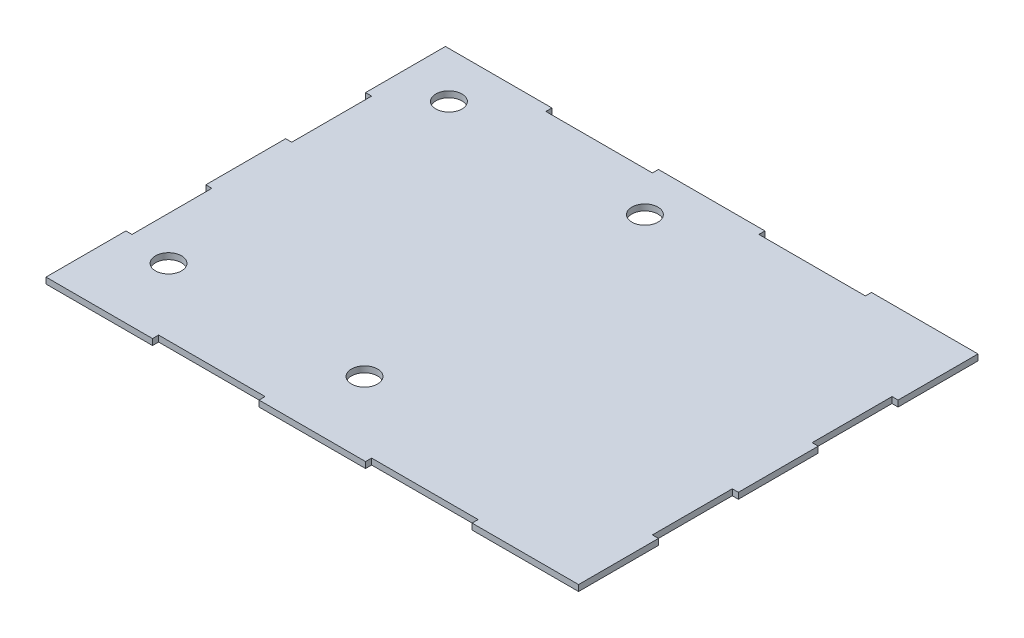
from build123d import *

# Parameters (mm, degrees)
BOSS_EXTRUDE2_DEPTH = 2.28
SKETCH10_4_R        = 4.9
CUT_EXTRUDE2_DEPTH  = 10


with BuildPart() as part:
    # Sketch2 → Boss-Extrude2 (new body)
    with BuildSketch(Plane(origin=(0, 0, 0), x_dir=(1, 0, 0), z_dir=(0, 1, 0))):
        Polygon((-100, -45), (-97.72, -45), (-97.72, -15), (-100, -15), (-100, 15), (-97.72, 15), (-97.72, 45), (-100, 45), (-100, 75), (-60, 75), (-60, 72.72), (-20, 72.72), (-20, 75), (20, 75), (20, 72.72), (60, 72.72), (60, 75), (100, 75), (100, 45), (97.72, 45), (97.72, 15), (100, 15), (100, -15), (97.72, -15), (97.72, -45), (100, -45), (100, -75), (60, -75), (60, -72.72), (20, -72.72), (20, -75), (-20, -75), (-20, -72.72), (-60, -72.72), (-60, -75), (-100, -75), align=None)
    extrude(amount=BOSS_EXTRUDE2_DEPTH)

    # Sketch10_4 → Cut-Extrude2 (cut)
    with BuildSketch(Plane(origin=(0, 2.28, 0), x_dir=(1, 0, 0), z_dir=(0, 1, 0))):
        with Locations(Location((-81.460382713, 57.770865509, 0), (0, 0, 270))):
            Circle(SKETCH10_4_R)
        with Locations(Location((-7.860382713, 57.770865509, 0), (0, 0, 270))):
            Circle(SKETCH10_4_R)
        with Locations(Location((-7.860382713, -47.529134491, 0), (0, 0, 270))):
            Circle(SKETCH10_4_R)
        with Locations(Location((-81.460382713, -47.529134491, 0), (0, 0, 270))):
            Circle(SKETCH10_4_R)
    extrude(amount=-CUT_EXTRUDE2_DEPTH, mode=Mode.SUBTRACT)


solid = part.part
